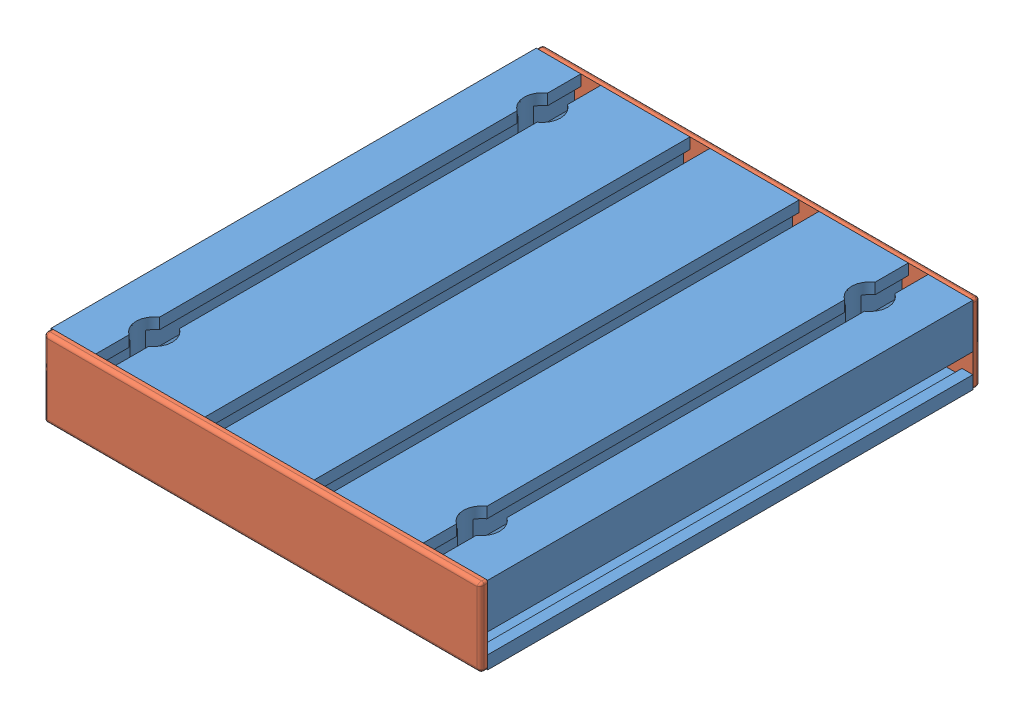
SolidWorks assembly 21.1734 FLOOR MOUNTING PLATE 90X180.SLDASM, configuration Default (file format 3800). Lengths in mm.
Overall size (180.01 32.01 206.01).
3 component instances, 2 part files, 6 mates.
Components (placement in the parent):
- 21.1734 FLOOR MOUNTING PLATE 90X180-1: 21.1734 FLOOR MOUNTING PLATE 90X180.SLDPRT [Default] at origin size (180 32 200)
- 22.1059_1 END CAP 32X180 GRAY-1: 22.1059_1 END CAP 32X180 GRAY.SLDPRT [Default] at (0 13 103) x (0 -1 0) z (0 0 -1) size (32.01 180.01 3)
- 22.1059_1 END CAP 32X180 GRAY-2: 22.1059_1 END CAP 32X180 GRAY.SLDPRT [Default] at (0 0 -103) x (0 1 0) z (0 0 1) size (32.01 180.01 3)
Mates (geometry in assembly coordinates):
- Coincident1: coincident anti-aligned: plane of 22.1059_1 END CAP 32X180 GRAY-1 through (0 6.5 100) normal (0 0 -1); plane of 21.1734 FLOOR MOUNTING PLATE 90X180-1 through (-74.3 18 100) normal (0 0 1)
- Coincident2: coincident aligned: plane of 21.1734 FLOOR MOUNTING PLATE 90X180-1 through (-26.6 22.5 -100) normal (0 1 0); plane of 22.1059_1 END CAP 32X180 GRAY-1 through (90 22.5 103) normal (0 1 0)
- Coincident3: coincident aligned: plane of 21.1734 FLOOR MOUNTING PLATE 90X180-1 through (90 4.1 -100) normal (1 0 0); plane of 22.1059_1 END CAP 32X180 GRAY-1 through (90 -9.5 103) normal (1 0 0)
- Coincident4: coincident anti-aligned: plane of 21.1734 FLOOR MOUNTING PLATE 90X180-1 through (-74.3 18 -100) normal (0 0 -1); plane of 22.1059_1 END CAP 32X180 GRAY-2 through (0 6.5 -100) normal (0 0 1)
- Coincident5: coincident aligned: plane of 22.1059_1 END CAP 32X180 GRAY-2 through (-90 22.5 -103) normal (0 1 0); plane of 21.1734 FLOOR MOUNTING PLATE 90X180-1 through (63.4 22.5 -100) normal (0 1 0)
- Coincident6: coincident aligned: plane of 21.1734 FLOOR MOUNTING PLATE 90X180-1 through (90 4.1 -100) normal (1 0 0); plane of 22.1059_1 END CAP 32X180 GRAY-2 through (90 22.5 -103) normal (1 0 0)
